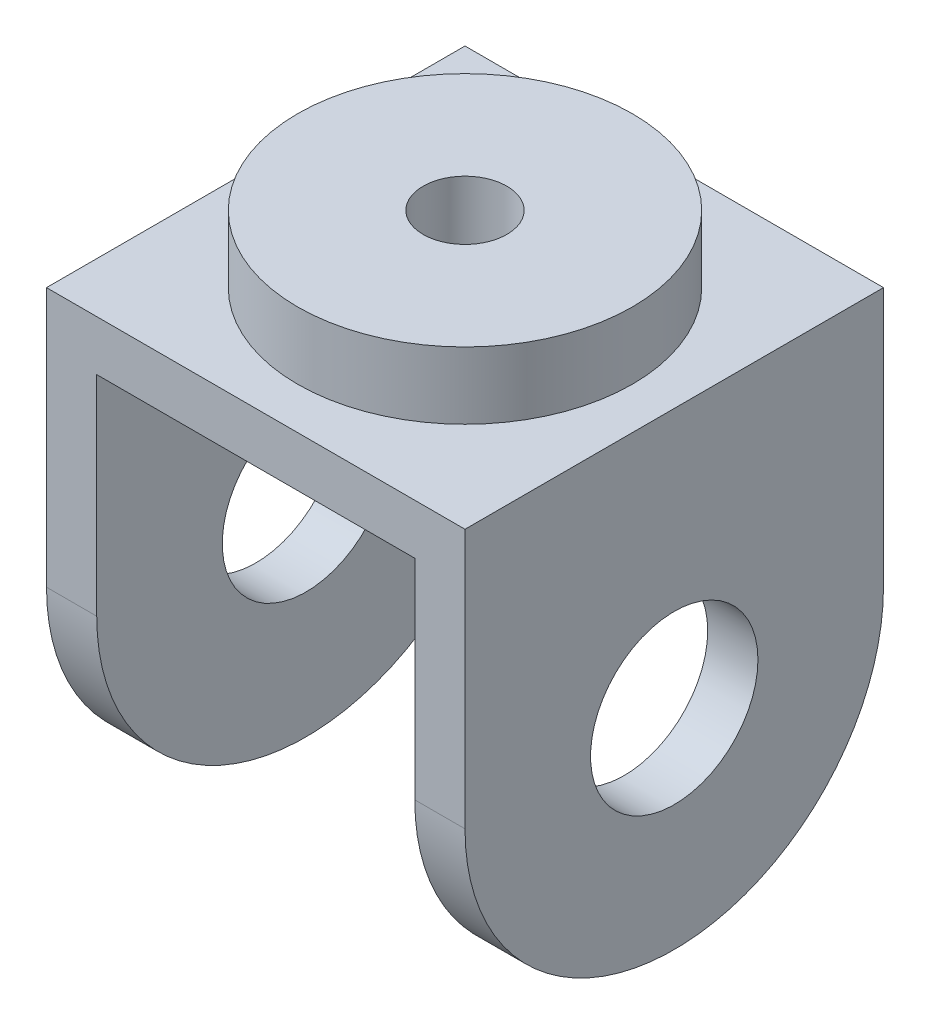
from build123d import *

# Parameters (mm, degrees)
SKETCH1_R           = 10
BOSS_EXTRUDE1_DEPTH = 6
SKETCH2_W           = 50
SKETCH2_H           = 50
BOSS_EXTRUDE2_DEPTH = 6
SKETCH3_R           = 20
BOSS_EXTRUDE3_DEPTH = 8
SKETCH4_R           = 5
CUT_EXTRUDE1_DEPTH  = 82.590440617


with BuildPart() as part:
    # Sketch1 → Boss-Extrude1 (new body)
    with BuildSketch(Plane(origin=(0, 0, 0), x_dir=(0, 0, -1), z_dir=(1, 0, 0))):
        with BuildLine():
            Line((-25, 0), (-25, 25))
            Line((-25, 25), (25, 25))
            Line((25, 25), (25, 0))
            ThreePointArc((25, 0), (0, -25), (-25, 0))
        make_face()
        Circle(SKETCH1_R, mode=Mode.SUBTRACT)
    boss_extrude1 = extrude(amount=BOSS_EXTRUDE1_DEPTH)

    # Sketch2 → Boss-Extrude2 (add)
    with BuildSketch(Plane(origin=(0, 25, 0), x_dir=(1, 0, 0), z_dir=(0, 1, 0))):
        with Locations((-19, 0)):
            Rectangle(SKETCH2_W, SKETCH2_H)
    extrude(amount=BOSS_EXTRUDE2_DEPTH)

    # Mirror1: Boss-Extrude1 across plane
    add(boss_extrude1.mirror(Plane(origin=(-19, 0, 0), x_dir=(0, 0, 1), z_dir=(1, 0, 0))))

    # Sketch3 → Boss-Extrude3 (add)
    with BuildSketch(Plane(origin=(0, 31, 0), x_dir=(1, 0, 0), z_dir=(0, 1, 0))):
        with Locations(Location((-19, 0, 0), (0, 0, 270))):
            Circle(SKETCH3_R)
    extrude(amount=BOSS_EXTRUDE3_DEPTH)

    # Sketch4 → Cut-Extrude1 (cut, through all)
    with BuildSketch(Plane(origin=(0, 39, 0), x_dir=(1, 0, 0), z_dir=(0, 1, 0))):
        with Locations(Location((-19, 0, 0), (0, 0, 270))):
            Circle(SKETCH4_R)
    extrude(amount=-CUT_EXTRUDE1_DEPTH, mode=Mode.SUBTRACT)


solid = part.part
